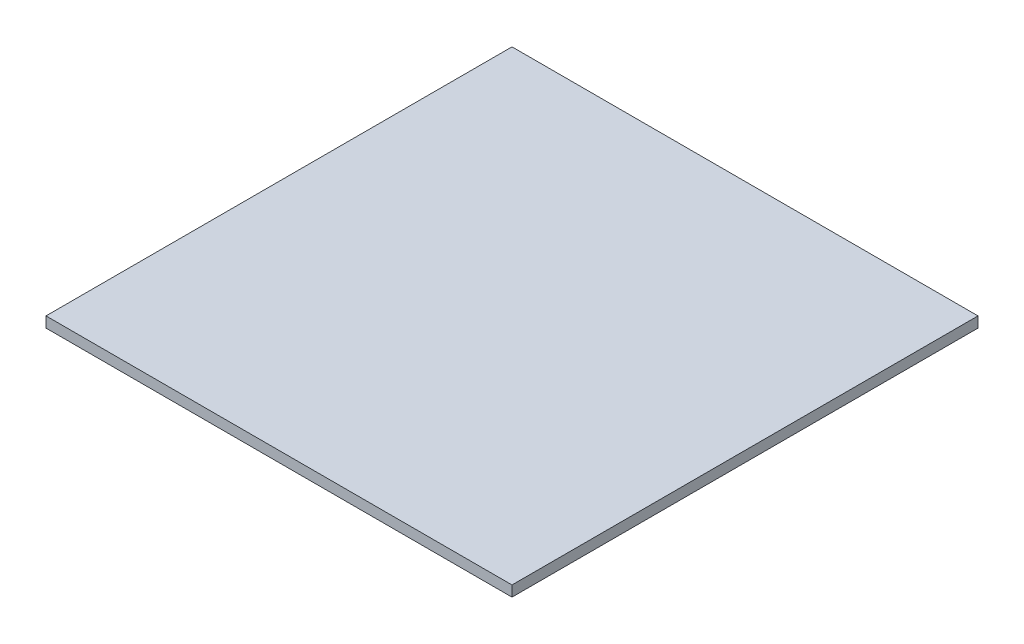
from build123d import *

# Parameters (mm, degrees)
SKETCH1_W           = 69.85
SKETCH1_H           = 69.85
BOSS_EXTRUDE1_DEPTH = 1.5875


with BuildPart() as part:
    # Sketch1 → Boss-Extrude1 (new body)
    with BuildSketch(Plane(origin=(0, 0, 0), x_dir=(1, 0, 0), z_dir=(0, 1, 0))):
        with Locations((0.124725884, 0.374177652)):
            Rectangle(SKETCH1_W, SKETCH1_H)
    extrude(amount=BOSS_EXTRUDE1_DEPTH)


solid = part.part
